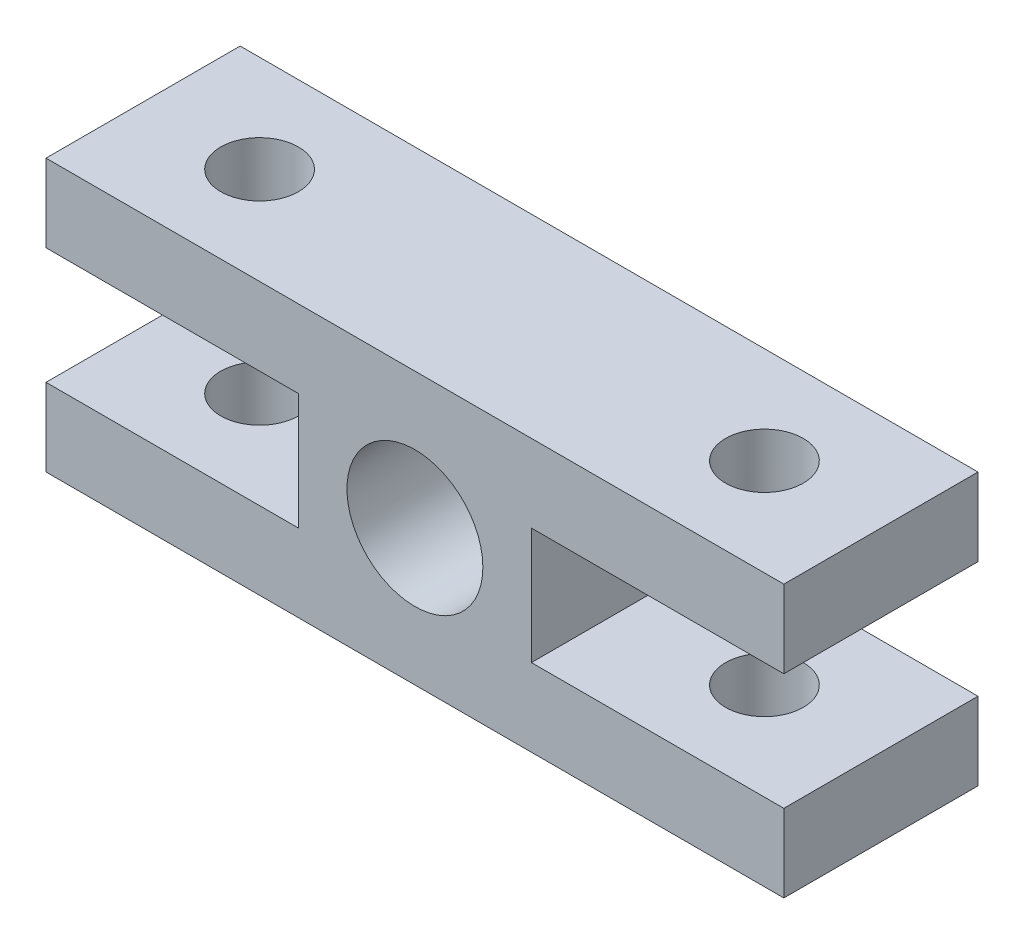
from build123d import *

# Parameters (mm, degrees)
BASE_EXTRUSION_DEPTH    = 20
ESQUISSE2_R             = 7
ENL_V_MAT_EXTRU_1_DEPTH = 20
ESQUISSE3_R             = 4
ENL_V_MAT_EXTRU_2_DEPTH = 33.736040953


with BuildPart() as part:
    # Esquisse1 → Base-Extrusion (new body)
    with BuildSketch(Plane.XY):
        Polygon((12, -6), (38, -6), (38, -14), (-38, -14), (-38, -6), (-12, -6), (-12, 6), (-38, 6), (-38, 14), (38, 14), (38, 6), (12, 6), align=None)
    extrude(amount=BASE_EXTRUSION_DEPTH)

    # Esquisse2 → Enl_v. mat.-Extru.1 (cut)
    with BuildSketch(Plane.XY.offset(20)):
        Circle(ESQUISSE2_R)
    extrude(amount=-ENL_V_MAT_EXTRU_1_DEPTH, mode=Mode.SUBTRACT)

    # Esquisse3 → Enl_v. mat.-Extru.2 (cut)
    with BuildSketch(Plane.XZ.offset(14)):
        with Locations(Location((26, 10, 0), (0, 0, 270))):
            Circle(ESQUISSE3_R)
    enl_v_mat_extru_2 = extrude(amount=-ENL_V_MAT_EXTRU_2_DEPTH, mode=Mode.SUBTRACT)

    # Sym_trie1: Enl_v. mat.-Extru.2 across plane
    add(enl_v_mat_extru_2.mirror(Plane(origin=(0, 0, 0), x_dir=(0, 0, 1), z_dir=(1, 0, 0))), mode=Mode.SUBTRACT)


solid = part.part
